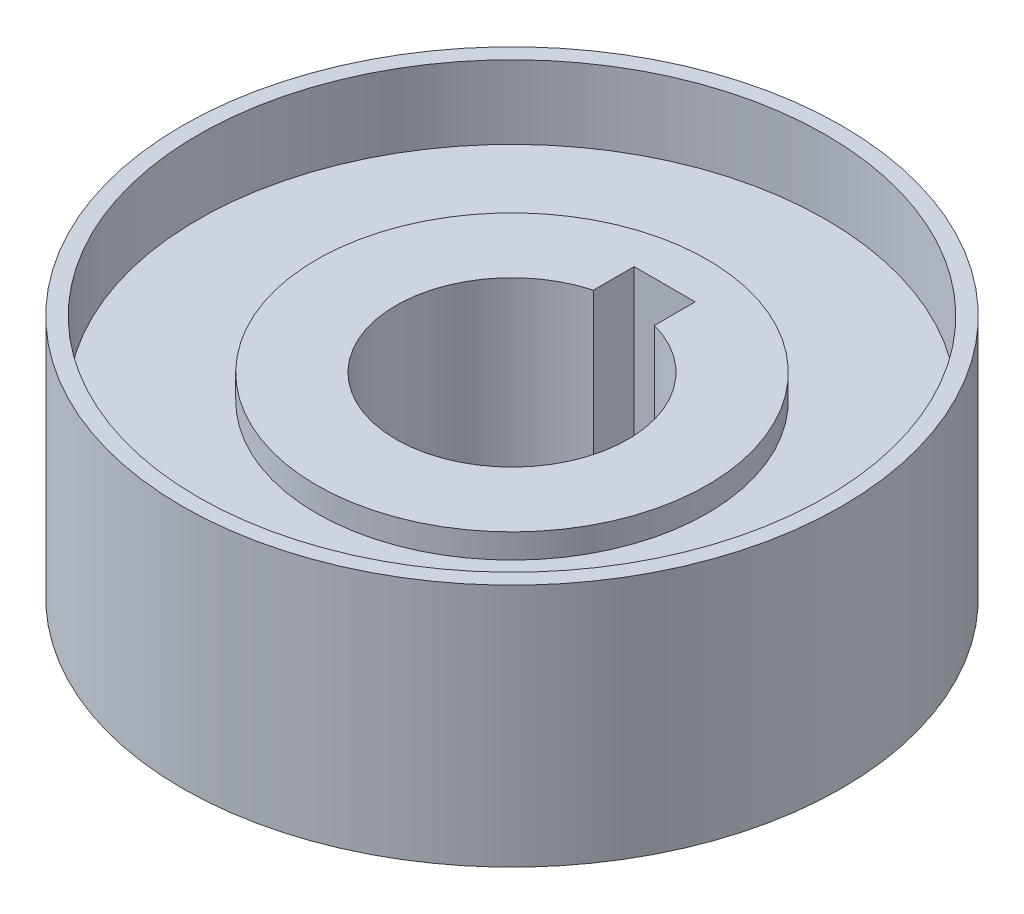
ISO-10303-21;
HEADER;
FILE_DESCRIPTION(('STEP AP214'),'2;1');
FILE_NAME('part.step','',(''),(''),'','','');
FILE_SCHEMA(('AUTOMOTIVE_DESIGN { 1 0 10303 214 1 1 1 1 }'));
ENDSEC;
DATA;
#1=APPLICATION_CONTEXT('core data for automotive mechanical design processes');
#2=APPLICATION_PROTOCOL_DEFINITION('international standard','automotive_design',2000,#1);
#3=PRODUCT_CONTEXT('',#1,'mechanical');
#4=PRODUCT('Part','Part','',(#3));
#5=PRODUCT_RELATED_PRODUCT_CATEGORY('part','',(#4));
#6=PRODUCT_DEFINITION_FORMATION('','',#4);
#7=PRODUCT_DEFINITION_CONTEXT('part definition',#1,'design');
#8=PRODUCT_DEFINITION('design','',#6,#7);
#9=PRODUCT_DEFINITION_SHAPE('','',#8);
#10=(LENGTH_UNIT() NAMED_UNIT(*) SI_UNIT(.MILLI.,.METRE.));
#11=(NAMED_UNIT(*) PLANE_ANGLE_UNIT() SI_UNIT($,.RADIAN.));
#12=(NAMED_UNIT(*) SI_UNIT($,.STERADIAN.) SOLID_ANGLE_UNIT());
#13=UNCERTAINTY_MEASURE_WITH_UNIT(LENGTH_MEASURE(1.E-05),#10,'distance_accuracy_value','');
#14=(GEOMETRIC_REPRESENTATION_CONTEXT(3) GLOBAL_UNCERTAINTY_ASSIGNED_CONTEXT((#13)) GLOBAL_UNIT_ASSIGNED_CONTEXT((#10,
#11,#12)) REPRESENTATION_CONTEXT('',''));
#15=CARTESIAN_POINT('',(0.,0.,0.));
#16=DIRECTION('',(0.,0.,1.));
#17=DIRECTION('',(1.,0.,0.));
#18=AXIS2_PLACEMENT_3D('',#15,#16,#17);
#19=CARTESIAN_POINT('',(0.,7.,0.));
#20=DIRECTION('',(0.,1.,0.));
#21=DIRECTION('',(0.,0.,1.));
#22=AXIS2_PLACEMENT_3D('',#19,#20,#21);
#23=CYLINDRICAL_SURFACE('',#22,8.);
#24=CARTESIAN_POINT('',(0.,7.,0.));
#25=DIRECTION('',(0.,1.,0.));
#26=DIRECTION('',(0.,0.,1.));
#27=AXIS2_PLACEMENT_3D('',#24,#25,#26);
#28=CIRCLE('',#27,8.);
#29=CARTESIAN_POINT('',(0.,7.,8.));
#30=VERTEX_POINT('',#29);
#31=EDGE_CURVE('E111',#30,#30,#28,.T.);
#32=ORIENTED_EDGE('',*,*,#31,.T.);
#33=EDGE_LOOP('',(#32));
#34=FACE_BOUND('',#33,.T.);
#35=CARTESIAN_POINT('',(0.,8.,0.));
#36=DIRECTION('',(0.,1.,0.));
#37=DIRECTION('',(0.,0.,1.));
#38=AXIS2_PLACEMENT_3D('',#35,#36,#37);
#39=CIRCLE('',#38,8.);
#40=CARTESIAN_POINT('',(0.,8.,8.));
#41=VERTEX_POINT('',#40);
#42=EDGE_CURVE('E105',#41,#41,#39,.T.);
#43=ORIENTED_EDGE('',*,*,#42,.F.);
#44=EDGE_LOOP('',(#43));
#45=FACE_BOUND('',#44,.T.);
#46=ADVANCED_FACE('F31',(#34,#45),#23,.T.);
#47=CARTESIAN_POINT('',(0.,10.,0.));
#48=DIRECTION('',(0.,-1.,0.));
#49=DIRECTION('',(0.,0.,-1.));
#50=AXIS2_PLACEMENT_3D('',#47,#48,#49);
#51=CYLINDRICAL_SURFACE('',#50,13.5);
#52=CARTESIAN_POINT('',(0.,10.,0.));
#53=DIRECTION('',(0.,1.,0.));
#54=DIRECTION('',(0.,0.,1.));
#55=AXIS2_PLACEMENT_3D('',#52,#53,#54);
#56=CIRCLE('',#55,13.5);
#57=CARTESIAN_POINT('',(0.,10.,13.5));
#58=VERTEX_POINT('',#57);
#59=EDGE_CURVE('E11',#58,#58,#56,.T.);
#60=ORIENTED_EDGE('',*,*,#59,.F.);
#61=EDGE_LOOP('',(#60));
#62=FACE_BOUND('',#61,.T.);
#63=CARTESIAN_POINT('',(0.,0.,0.));
#64=DIRECTION('',(0.,1.,0.));
#65=DIRECTION('',(0.,0.,1.));
#66=AXIS2_PLACEMENT_3D('',#63,#64,#65);
#67=CIRCLE('',#66,13.5);
#68=CARTESIAN_POINT('',(0.,0.,13.5));
#69=VERTEX_POINT('',#68);
#70=EDGE_CURVE('E35',#69,#69,#67,.T.);
#71=ORIENTED_EDGE('',*,*,#70,.T.);
#72=EDGE_LOOP('',(#71));
#73=FACE_BOUND('',#72,.T.);
#74=ADVANCED_FACE('F33',(#62,#73),#51,.T.);
#75=CARTESIAN_POINT('',(0.,10.,0.));
#76=DIRECTION('',(0.,1.,0.));
#77=DIRECTION('',(0.,0.,1.));
#78=AXIS2_PLACEMENT_3D('',#75,#76,#77);
#79=PLANE('',#78);
#80=CARTESIAN_POINT('',(0.,10.,0.));
#81=DIRECTION('',(0.,1.,0.));
#82=DIRECTION('',(0.,0.,1.));
#83=AXIS2_PLACEMENT_3D('',#80,#81,#82);
#84=CIRCLE('',#83,12.85);
#85=CARTESIAN_POINT('',(0.,10.,12.85));
#86=VERTEX_POINT('',#85);
#87=EDGE_CURVE('E114',#86,#86,#84,.T.);
#88=ORIENTED_EDGE('',*,*,#87,.F.);
#89=EDGE_LOOP('',(#88));
#90=FACE_BOUND('',#89,.T.);
#91=ORIENTED_EDGE('',*,*,#59,.T.);
#92=EDGE_LOOP('',(#91));
#93=FACE_BOUND('',#92,.T.);
#94=ADVANCED_FACE('F123',(#90,#93),#79,.T.);
#95=CARTESIAN_POINT('',(0.,0.,0.));
#96=DIRECTION('',(0.,1.,0.));
#97=DIRECTION('',(0.,0.,1.));
#98=AXIS2_PLACEMENT_3D('',#95,#96,#97);
#99=PLANE('',#98);
#100=CARTESIAN_POINT('',(0.,0.,0.));
#101=DIRECTION('',(0.,1.,0.));
#102=DIRECTION('',(0.,0.,1.));
#103=AXIS2_PLACEMENT_3D('',#100,#101,#102);
#104=CIRCLE('',#103,4.75);
#105=CARTESIAN_POINT('',(-1.25,0.,-4.58257569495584));
#106=VERTEX_POINT('',#105);
#107=CARTESIAN_POINT('',(1.25,0.,-4.58257569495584));
#108=VERTEX_POINT('',#107);
#109=EDGE_CURVE('E80',#106,#108,#104,.T.);
#110=ORIENTED_EDGE('',*,*,#109,.T.);
#111=DIRECTION('',(0.,0.,-1.));
#112=VECTOR('',#111,1.);
#113=CARTESIAN_POINT('',(1.25,0.,-4.58257569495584));
#114=LINE('',#113,#112);
#115=CARTESIAN_POINT('',(1.25,0.,-6.25));
#116=VERTEX_POINT('',#115);
#117=EDGE_CURVE('E74',#108,#116,#114,.T.);
#118=ORIENTED_EDGE('',*,*,#117,.T.);
#119=DIRECTION('',(-1.,0.,0.));
#120=VECTOR('',#119,1.);
#121=CARTESIAN_POINT('',(-1.25,0.,-6.25));
#122=LINE('',#121,#120);
#123=CARTESIAN_POINT('',(-1.25,0.,-6.25));
#124=VERTEX_POINT('',#123);
#125=EDGE_CURVE('E83',#116,#124,#122,.T.);
#126=ORIENTED_EDGE('',*,*,#125,.T.);
#127=DIRECTION('',(0.,0.,1.));
#128=VECTOR('',#127,1.);
#129=CARTESIAN_POINT('',(-1.25,0.,-4.58257569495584));
#130=LINE('',#129,#128);
#131=EDGE_CURVE('E46',#124,#106,#130,.T.);
#132=ORIENTED_EDGE('',*,*,#131,.T.);
#133=EDGE_LOOP('',(#110,#118,#126,#132));
#134=FACE_BOUND('',#133,.T.);
#135=ORIENTED_EDGE('',*,*,#70,.F.);
#136=EDGE_LOOP('',(#135));
#137=FACE_BOUND('',#136,.T.);
#138=ADVANCED_FACE('F87',(#134,#137),#99,.F.);
#139=CARTESIAN_POINT('',(0.,7.,0.));
#140=DIRECTION('',(0.,1.,0.));
#141=DIRECTION('',(0.,0.,1.));
#142=AXIS2_PLACEMENT_3D('',#139,#140,#141);
#143=CYLINDRICAL_SURFACE('',#142,12.85);
#144=CARTESIAN_POINT('',(0.,7.,0.));
#145=DIRECTION('',(0.,1.,0.));
#146=DIRECTION('',(0.,0.,1.));
#147=AXIS2_PLACEMENT_3D('',#144,#145,#146);
#148=CIRCLE('',#147,12.85);
#149=CARTESIAN_POINT('',(0.,7.,12.85));
#150=VERTEX_POINT('',#149);
#151=EDGE_CURVE('E115',#150,#150,#148,.T.);
#152=ORIENTED_EDGE('',*,*,#151,.F.);
#153=EDGE_LOOP('',(#152));
#154=FACE_BOUND('',#153,.T.);
#155=ORIENTED_EDGE('',*,*,#87,.T.);
#156=EDGE_LOOP('',(#155));
#157=FACE_BOUND('',#156,.T.);
#158=ADVANCED_FACE('F121',(#154,#157),#143,.F.);
#159=CARTESIAN_POINT('',(0.,7.,0.));
#160=DIRECTION('',(0.,1.,0.));
#161=DIRECTION('',(0.,0.,1.));
#162=AXIS2_PLACEMENT_3D('',#159,#160,#161);
#163=PLANE('',#162);
#164=ORIENTED_EDGE('',*,*,#31,.F.);
#165=EDGE_LOOP('',(#164));
#166=FACE_BOUND('',#165,.T.);
#167=ORIENTED_EDGE('',*,*,#151,.T.);
#168=EDGE_LOOP('',(#167));
#169=FACE_BOUND('',#168,.T.);
#170=ADVANCED_FACE('F137',(#166,#169),#163,.T.);
#171=CARTESIAN_POINT('',(0.,8.,0.));
#172=DIRECTION('',(0.,1.,0.));
#173=DIRECTION('',(0.,0.,1.));
#174=AXIS2_PLACEMENT_3D('',#171,#172,#173);
#175=PLANE('',#174);
#176=DIRECTION('',(0.,0.,-1.));
#177=VECTOR('',#176,1.);
#178=CARTESIAN_POINT('',(1.25,8.,-4.58257569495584));
#179=LINE('',#178,#177);
#180=CARTESIAN_POINT('',(1.25,8.,-4.58257569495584));
#181=VERTEX_POINT('',#180);
#182=CARTESIAN_POINT('',(1.25,8.,-6.25));
#183=VERTEX_POINT('',#182);
#184=EDGE_CURVE('E54',#181,#183,#179,.T.);
#185=ORIENTED_EDGE('',*,*,#184,.F.);
#186=CARTESIAN_POINT('',(0.,8.,0.));
#187=DIRECTION('',(0.,1.,0.));
#188=DIRECTION('',(0.,0.,1.));
#189=AXIS2_PLACEMENT_3D('',#186,#187,#188);
#190=CIRCLE('',#189,4.75);
#191=CARTESIAN_POINT('',(-1.25,8.,-4.58257569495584));
#192=VERTEX_POINT('',#191);
#193=EDGE_CURVE('E90',#192,#181,#190,.T.);
#194=ORIENTED_EDGE('',*,*,#193,.F.);
#195=DIRECTION('',(0.,0.,1.));
#196=VECTOR('',#195,1.);
#197=CARTESIAN_POINT('',(-1.25,8.,-4.58257569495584));
#198=LINE('',#197,#196);
#199=CARTESIAN_POINT('',(-1.25,8.,-6.25));
#200=VERTEX_POINT('',#199);
#201=EDGE_CURVE('E93',#200,#192,#198,.T.);
#202=ORIENTED_EDGE('',*,*,#201,.F.);
#203=DIRECTION('',(-1.,0.,0.));
#204=VECTOR('',#203,1.);
#205=CARTESIAN_POINT('',(-1.25,8.,-6.25));
#206=LINE('',#205,#204);
#207=EDGE_CURVE('E99',#183,#200,#206,.T.);
#208=ORIENTED_EDGE('',*,*,#207,.F.);
#209=EDGE_LOOP('',(#185,#194,#202,#208));
#210=FACE_BOUND('',#209,.T.);
#211=ORIENTED_EDGE('',*,*,#42,.T.);
#212=EDGE_LOOP('',(#211));
#213=FACE_BOUND('',#212,.T.);
#214=ADVANCED_FACE('F148',(#210,#213),#175,.T.);
#215=CARTESIAN_POINT('',(1.25,0.,-4.58257569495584));
#216=DIRECTION('',(1.,0.,0.));
#217=DIRECTION('',(0.,0.,-1.));
#218=AXIS2_PLACEMENT_3D('',#215,#216,#217);
#219=PLANE('',#218);
#220=ORIENTED_EDGE('',*,*,#184,.T.);
#221=DIRECTION('',(0.,1.,0.));
#222=VECTOR('',#221,1.);
#223=CARTESIAN_POINT('',(1.25,0.,-6.25));
#224=LINE('',#223,#222);
#225=EDGE_CURVE('E70',#116,#183,#224,.T.);
#226=ORIENTED_EDGE('',*,*,#225,.F.);
#227=ORIENTED_EDGE('',*,*,#117,.F.);
#228=DIRECTION('',(0.,1.,0.));
#229=VECTOR('',#228,1.);
#230=CARTESIAN_POINT('',(1.25,0.,-4.58257569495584));
#231=LINE('',#230,#229);
#232=EDGE_CURVE('E103',#108,#181,#231,.T.);
#233=ORIENTED_EDGE('',*,*,#232,.T.);
#234=EDGE_LOOP('',(#220,#226,#227,#233));
#235=FACE_BOUND('',#234,.T.);
#236=ADVANCED_FACE('F72',(#235),#219,.F.);
#237=CARTESIAN_POINT('',(0.,0.,0.));
#238=DIRECTION('',(0.,1.,0.));
#239=DIRECTION('',(0.,0.,1.));
#240=AXIS2_PLACEMENT_3D('',#237,#238,#239);
#241=CYLINDRICAL_SURFACE('',#240,4.75);
#242=ORIENTED_EDGE('',*,*,#193,.T.);
#243=ORIENTED_EDGE('',*,*,#232,.F.);
#244=ORIENTED_EDGE('',*,*,#109,.F.);
#245=DIRECTION('',(0.,1.,0.));
#246=VECTOR('',#245,1.);
#247=CARTESIAN_POINT('',(-1.25,0.,-4.58257569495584));
#248=LINE('',#247,#246);
#249=EDGE_CURVE('E106',#106,#192,#248,.T.);
#250=ORIENTED_EDGE('',*,*,#249,.T.);
#251=EDGE_LOOP('',(#242,#243,#244,#250));
#252=FACE_BOUND('',#251,.T.);
#253=ADVANCED_FACE('F162',(#252),#241,.F.);
#254=CARTESIAN_POINT('',(-1.25,0.,-4.58257569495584));
#255=DIRECTION('',(-1.,0.,0.));
#256=DIRECTION('',(0.,0.,1.));
#257=AXIS2_PLACEMENT_3D('',#254,#255,#256);
#258=PLANE('',#257);
#259=ORIENTED_EDGE('',*,*,#201,.T.);
#260=ORIENTED_EDGE('',*,*,#249,.F.);
#261=ORIENTED_EDGE('',*,*,#131,.F.);
#262=DIRECTION('',(0.,1.,0.));
#263=VECTOR('',#262,1.);
#264=CARTESIAN_POINT('',(-1.25,0.,-6.25));
#265=LINE('',#264,#263);
#266=EDGE_CURVE('E79',#124,#200,#265,.T.);
#267=ORIENTED_EDGE('',*,*,#266,.T.);
#268=EDGE_LOOP('',(#259,#260,#261,#267));
#269=FACE_BOUND('',#268,.T.);
#270=ADVANCED_FACE('F167',(#269),#258,.F.);
#271=CARTESIAN_POINT('',(-1.25,0.,-6.25));
#272=DIRECTION('',(0.,0.,-1.));
#273=DIRECTION('',(-1.,0.,0.));
#274=AXIS2_PLACEMENT_3D('',#271,#272,#273);
#275=PLANE('',#274);
#276=ORIENTED_EDGE('',*,*,#207,.T.);
#277=ORIENTED_EDGE('',*,*,#266,.F.);
#278=ORIENTED_EDGE('',*,*,#125,.F.);
#279=ORIENTED_EDGE('',*,*,#225,.T.);
#280=EDGE_LOOP('',(#276,#277,#278,#279));
#281=FACE_BOUND('',#280,.T.);
#282=ADVANCED_FACE('F84',(#281),#275,.F.);
#283=CLOSED_SHELL('',(#46,#74,#94,#138,#158,#170,#214,#236,#253,#270,#282));
#284=MANIFOLD_SOLID_BREP('B2',#283);
#285=ADVANCED_BREP_SHAPE_REPRESENTATION('',(#18,#284),#14);
#286=SHAPE_DEFINITION_REPRESENTATION(#9,#285);
ENDSEC;
END-ISO-10303-21;
